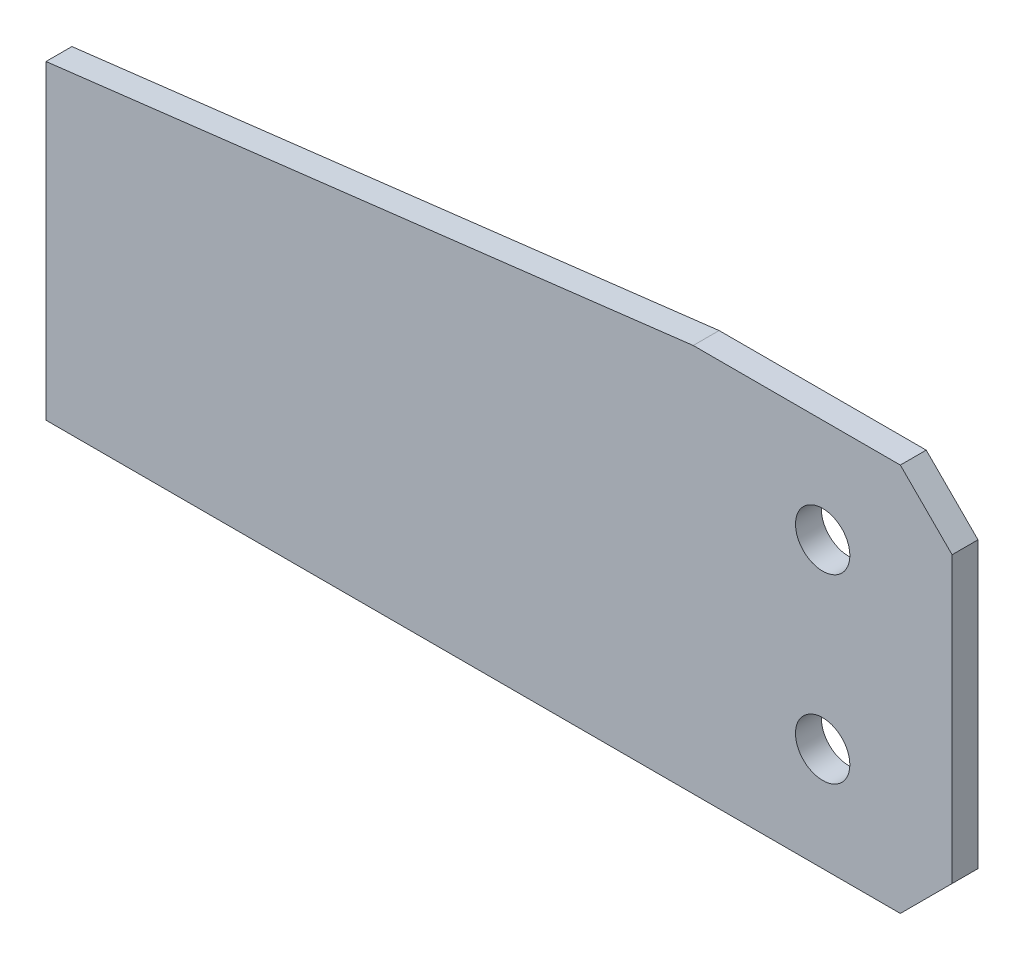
ISO-10303-21;
HEADER;
FILE_DESCRIPTION(('STEP AP214'),'2;1');
FILE_NAME('part.step','',(''),(''),'','','');
FILE_SCHEMA(('AUTOMOTIVE_DESIGN { 1 0 10303 214 1 1 1 1 }'));
ENDSEC;
DATA;
#1=APPLICATION_CONTEXT('core data for automotive mechanical design processes');
#2=APPLICATION_PROTOCOL_DEFINITION('international standard','automotive_design',2000,#1);
#3=PRODUCT_CONTEXT('',#1,'mechanical');
#4=PRODUCT('Part','Part','',(#3));
#5=PRODUCT_RELATED_PRODUCT_CATEGORY('part','',(#4));
#6=PRODUCT_DEFINITION_FORMATION('','',#4);
#7=PRODUCT_DEFINITION_CONTEXT('part definition',#1,'design');
#8=PRODUCT_DEFINITION('design','',#6,#7);
#9=PRODUCT_DEFINITION_SHAPE('','',#8);
#10=(LENGTH_UNIT() NAMED_UNIT(*) SI_UNIT(.MILLI.,.METRE.));
#11=(NAMED_UNIT(*) PLANE_ANGLE_UNIT() SI_UNIT($,.RADIAN.));
#12=(NAMED_UNIT(*) SI_UNIT($,.STERADIAN.) SOLID_ANGLE_UNIT());
#13=UNCERTAINTY_MEASURE_WITH_UNIT(LENGTH_MEASURE(1.E-05),#10,'distance_accuracy_value','');
#14=(GEOMETRIC_REPRESENTATION_CONTEXT(3) GLOBAL_UNCERTAINTY_ASSIGNED_CONTEXT((#13)) GLOBAL_UNIT_ASSIGNED_CONTEXT((#10,
#11,#12)) REPRESENTATION_CONTEXT('',''));
#15=CARTESIAN_POINT('',(0.,0.,0.));
#16=DIRECTION('',(0.,0.,1.));
#17=DIRECTION('',(1.,0.,0.));
#18=AXIS2_PLACEMENT_3D('',#15,#16,#17);
#19=CARTESIAN_POINT('',(-350.,-150.,10.));
#20=DIRECTION('',(0.,0.,-1.));
#21=DIRECTION('',(-1.,0.,0.));
#22=AXIS2_PLACEMENT_3D('',#19,#20,#21);
#23=PLANE('',#22);
#24=CARTESIAN_POINT('',(-50.,-40.,10.));
#25=DIRECTION('',(0.,0.,1.));
#26=DIRECTION('',(1.,0.,0.));
#27=AXIS2_PLACEMENT_3D('',#24,#25,#26);
#28=CIRCLE('',#27,10.5);
#29=CARTESIAN_POINT('',(-39.5,-40.,10.));
#30=VERTEX_POINT('',#29);
#31=EDGE_CURVE('E107',#30,#30,#28,.T.);
#32=ORIENTED_EDGE('',*,*,#31,.F.);
#33=EDGE_LOOP('',(#32));
#34=FACE_BOUND('',#33,.T.);
#35=DIRECTION('',(0.,-1.,0.));
#36=VECTOR('',#35,1.);
#37=CARTESIAN_POINT('',(-350.,-30.0000000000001,10.));
#38=LINE('',#37,#36);
#39=CARTESIAN_POINT('',(-350.,-30.0000000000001,10.));
#40=VERTEX_POINT('',#39);
#41=CARTESIAN_POINT('',(-350.,-150.,10.));
#42=VERTEX_POINT('',#41);
#43=EDGE_CURVE('E123',#40,#42,#38,.T.);
#44=ORIENTED_EDGE('',*,*,#43,.T.);
#45=DIRECTION('',(1.,0.,0.));
#46=VECTOR('',#45,1.);
#47=CARTESIAN_POINT('',(-20.,-150.,10.));
#48=LINE('',#47,#46);
#49=CARTESIAN_POINT('',(-20.,-150.,10.));
#50=VERTEX_POINT('',#49);
#51=EDGE_CURVE('E102',#42,#50,#48,.T.);
#52=ORIENTED_EDGE('',*,*,#51,.T.);
#53=DIRECTION('',(0.707106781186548,0.707106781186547,0.));
#54=VECTOR('',#53,1.);
#55=CARTESIAN_POINT('',(0.,-130.,10.));
#56=LINE('',#55,#54);
#57=CARTESIAN_POINT('',(0.,-130.,10.));
#58=VERTEX_POINT('',#57);
#59=EDGE_CURVE('E126',#50,#58,#56,.T.);
#60=ORIENTED_EDGE('',*,*,#59,.T.);
#61=DIRECTION('',(0.,1.,0.));
#62=VECTOR('',#61,1.);
#63=CARTESIAN_POINT('',(0.,-19.9999999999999,10.));
#64=LINE('',#63,#62);
#65=CARTESIAN_POINT('',(0.,-19.9999999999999,10.));
#66=VERTEX_POINT('',#65);
#67=EDGE_CURVE('E128',#58,#66,#64,.T.);
#68=ORIENTED_EDGE('',*,*,#67,.T.);
#69=DIRECTION('',(-0.707106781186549,0.707106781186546,0.));
#70=VECTOR('',#69,1.);
#71=CARTESIAN_POINT('',(0.,-19.9999999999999,10.));
#72=LINE('',#71,#70);
#73=CARTESIAN_POINT('',(-20.,0.,10.));
#74=VERTEX_POINT('',#73);
#75=EDGE_CURVE('E130',#66,#74,#72,.T.);
#76=ORIENTED_EDGE('',*,*,#75,.T.);
#77=DIRECTION('',(-1.,0.,0.));
#78=VECTOR('',#77,1.);
#79=CARTESIAN_POINT('',(-20.,0.,10.));
#80=LINE('',#79,#78);
#81=CARTESIAN_POINT('',(-100.,0.,10.));
#82=VERTEX_POINT('',#81);
#83=EDGE_CURVE('E49',#74,#82,#80,.T.);
#84=ORIENTED_EDGE('',*,*,#83,.T.);
#85=DIRECTION('',(-0.992876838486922,-0.119145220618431,0.));
#86=VECTOR('',#85,1.);
#87=CARTESIAN_POINT('',(-100.,0.,10.));
#88=LINE('',#87,#86);
#89=EDGE_CURVE('E44',#82,#40,#88,.T.);
#90=ORIENTED_EDGE('',*,*,#89,.T.);
#91=EDGE_LOOP('',(#44,#52,#60,#68,#76,#84,#90));
#92=FACE_BOUND('',#91,.T.);
#93=CARTESIAN_POINT('',(-50.,-110.,10.));
#94=DIRECTION('',(0.,0.,1.));
#95=DIRECTION('',(1.,0.,0.));
#96=AXIS2_PLACEMENT_3D('',#93,#94,#95);
#97=CIRCLE('',#96,10.5);
#98=CARTESIAN_POINT('',(-39.5,-110.,10.));
#99=VERTEX_POINT('',#98);
#100=EDGE_CURVE('E193',#99,#99,#97,.T.);
#101=ORIENTED_EDGE('',*,*,#100,.F.);
#102=EDGE_LOOP('',(#101));
#103=FACE_BOUND('',#102,.T.);
#104=ADVANCED_FACE('F29',(#34,#92,#103),#23,.F.);
#105=CARTESIAN_POINT('',(-350.,-150.,0.));
#106=DIRECTION('',(0.,0.,-1.));
#107=DIRECTION('',(-1.,0.,0.));
#108=AXIS2_PLACEMENT_3D('',#105,#106,#107);
#109=PLANE('',#108);
#110=CARTESIAN_POINT('',(-50.,-40.,0.));
#111=DIRECTION('',(0.,0.,1.));
#112=DIRECTION('',(1.,0.,0.));
#113=AXIS2_PLACEMENT_3D('',#110,#111,#112);
#114=CIRCLE('',#113,10.5);
#115=CARTESIAN_POINT('',(-39.5,-40.,0.));
#116=VERTEX_POINT('',#115);
#117=EDGE_CURVE('E110',#116,#116,#114,.T.);
#118=ORIENTED_EDGE('',*,*,#117,.T.);
#119=EDGE_LOOP('',(#118));
#120=FACE_BOUND('',#119,.T.);
#121=DIRECTION('',(0.,-1.,0.));
#122=VECTOR('',#121,1.);
#123=CARTESIAN_POINT('',(-350.,-30.0000000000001,0.));
#124=LINE('',#123,#122);
#125=CARTESIAN_POINT('',(-350.,-30.0000000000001,0.));
#126=VERTEX_POINT('',#125);
#127=CARTESIAN_POINT('',(-350.,-150.,0.));
#128=VERTEX_POINT('',#127);
#129=EDGE_CURVE('E93',#126,#128,#124,.T.);
#130=ORIENTED_EDGE('',*,*,#129,.F.);
#131=DIRECTION('',(-0.992876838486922,-0.119145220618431,0.));
#132=VECTOR('',#131,1.);
#133=CARTESIAN_POINT('',(-100.,0.,0.));
#134=LINE('',#133,#132);
#135=CARTESIAN_POINT('',(-100.,0.,0.));
#136=VERTEX_POINT('',#135);
#137=EDGE_CURVE('E121',#136,#126,#134,.T.);
#138=ORIENTED_EDGE('',*,*,#137,.F.);
#139=DIRECTION('',(-1.,0.,0.));
#140=VECTOR('',#139,1.);
#141=CARTESIAN_POINT('',(-20.,0.,0.));
#142=LINE('',#141,#140);
#143=CARTESIAN_POINT('',(-20.,0.,0.));
#144=VERTEX_POINT('',#143);
#145=EDGE_CURVE('E119',#144,#136,#142,.T.);
#146=ORIENTED_EDGE('',*,*,#145,.F.);
#147=DIRECTION('',(-0.707106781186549,0.707106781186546,0.));
#148=VECTOR('',#147,1.);
#149=CARTESIAN_POINT('',(0.,-19.9999999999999,0.));
#150=LINE('',#149,#148);
#151=CARTESIAN_POINT('',(0.,-19.9999999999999,0.));
#152=VERTEX_POINT('',#151);
#153=EDGE_CURVE('E117',#152,#144,#150,.T.);
#154=ORIENTED_EDGE('',*,*,#153,.F.);
#155=DIRECTION('',(0.,1.,0.));
#156=VECTOR('',#155,1.);
#157=CARTESIAN_POINT('',(0.,-19.9999999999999,0.));
#158=LINE('',#157,#156);
#159=CARTESIAN_POINT('',(0.,-130.,0.));
#160=VERTEX_POINT('',#159);
#161=EDGE_CURVE('E115',#160,#152,#158,.T.);
#162=ORIENTED_EDGE('',*,*,#161,.F.);
#163=DIRECTION('',(0.707106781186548,0.707106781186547,0.));
#164=VECTOR('',#163,1.);
#165=CARTESIAN_POINT('',(0.,-130.,0.));
#166=LINE('',#165,#164);
#167=CARTESIAN_POINT('',(-20.,-150.,0.));
#168=VERTEX_POINT('',#167);
#169=EDGE_CURVE('E95',#168,#160,#166,.T.);
#170=ORIENTED_EDGE('',*,*,#169,.F.);
#171=DIRECTION('',(1.,0.,0.));
#172=VECTOR('',#171,1.);
#173=CARTESIAN_POINT('',(-20.,-150.,0.));
#174=LINE('',#173,#172);
#175=EDGE_CURVE('E88',#128,#168,#174,.T.);
#176=ORIENTED_EDGE('',*,*,#175,.F.);
#177=EDGE_LOOP('',(#130,#138,#146,#154,#162,#170,#176));
#178=FACE_BOUND('',#177,.T.);
#179=CARTESIAN_POINT('',(-50.,-110.,0.));
#180=DIRECTION('',(0.,0.,1.));
#181=DIRECTION('',(1.,0.,0.));
#182=AXIS2_PLACEMENT_3D('',#179,#180,#181);
#183=CIRCLE('',#182,10.5);
#184=CARTESIAN_POINT('',(-39.5,-110.,0.));
#185=VERTEX_POINT('',#184);
#186=EDGE_CURVE('E196',#185,#185,#183,.T.);
#187=ORIENTED_EDGE('',*,*,#186,.T.);
#188=EDGE_LOOP('',(#187));
#189=FACE_BOUND('',#188,.T.);
#190=ADVANCED_FACE('F89',(#120,#178,#189),#109,.T.);
#191=CARTESIAN_POINT('',(-350.,-30.0000000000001,10.));
#192=DIRECTION('',(1.,0.,0.));
#193=DIRECTION('',(0.,0.,-1.));
#194=AXIS2_PLACEMENT_3D('',#191,#192,#193);
#195=PLANE('',#194);
#196=ORIENTED_EDGE('',*,*,#129,.T.);
#197=DIRECTION('',(0.,0.,-1.));
#198=VECTOR('',#197,1.);
#199=CARTESIAN_POINT('',(-350.,-150.,10.));
#200=LINE('',#199,#198);
#201=EDGE_CURVE('E11',#42,#128,#200,.T.);
#202=ORIENTED_EDGE('',*,*,#201,.F.);
#203=ORIENTED_EDGE('',*,*,#43,.F.);
#204=DIRECTION('',(0.,0.,-1.));
#205=VECTOR('',#204,1.);
#206=CARTESIAN_POINT('',(-350.,-30.0000000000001,10.));
#207=LINE('',#206,#205);
#208=EDGE_CURVE('E106',#40,#126,#207,.T.);
#209=ORIENTED_EDGE('',*,*,#208,.T.);
#210=EDGE_LOOP('',(#196,#202,#203,#209));
#211=FACE_BOUND('',#210,.T.);
#212=ADVANCED_FACE('F31',(#211),#195,.F.);
#213=CARTESIAN_POINT('',(-20.,-150.,10.));
#214=DIRECTION('',(0.,1.,0.));
#215=DIRECTION('',(-1.,0.,0.));
#216=AXIS2_PLACEMENT_3D('',#213,#214,#215);
#217=PLANE('',#216);
#218=ORIENTED_EDGE('',*,*,#175,.T.);
#219=DIRECTION('',(0.,0.,-1.));
#220=VECTOR('',#219,1.);
#221=CARTESIAN_POINT('',(-20.,-150.,10.));
#222=LINE('',#221,#220);
#223=EDGE_CURVE('E37',#50,#168,#222,.T.);
#224=ORIENTED_EDGE('',*,*,#223,.F.);
#225=ORIENTED_EDGE('',*,*,#51,.F.);
#226=ORIENTED_EDGE('',*,*,#201,.T.);
#227=EDGE_LOOP('',(#218,#224,#225,#226));
#228=FACE_BOUND('',#227,.T.);
#229=ADVANCED_FACE('F101',(#228),#217,.F.);
#230=CARTESIAN_POINT('',(0.,-130.,10.));
#231=DIRECTION('',(-0.707106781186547,0.707106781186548,0.));
#232=DIRECTION('',(-0.707106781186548,-0.707106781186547,0.));
#233=AXIS2_PLACEMENT_3D('',#230,#231,#232);
#234=PLANE('',#233);
#235=ORIENTED_EDGE('',*,*,#169,.T.);
#236=DIRECTION('',(0.,0.,-1.));
#237=VECTOR('',#236,1.);
#238=CARTESIAN_POINT('',(0.,-130.,10.));
#239=LINE('',#238,#237);
#240=EDGE_CURVE('E144',#58,#160,#239,.T.);
#241=ORIENTED_EDGE('',*,*,#240,.F.);
#242=ORIENTED_EDGE('',*,*,#59,.F.);
#243=ORIENTED_EDGE('',*,*,#223,.T.);
#244=EDGE_LOOP('',(#235,#241,#242,#243));
#245=FACE_BOUND('',#244,.T.);
#246=ADVANCED_FACE('F148',(#245),#234,.F.);
#247=CARTESIAN_POINT('',(0.,-19.9999999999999,10.));
#248=DIRECTION('',(-1.,0.,0.));
#249=DIRECTION('',(0.,-1.,0.));
#250=AXIS2_PLACEMENT_3D('',#247,#248,#249);
#251=PLANE('',#250);
#252=ORIENTED_EDGE('',*,*,#161,.T.);
#253=DIRECTION('',(0.,0.,-1.));
#254=VECTOR('',#253,1.);
#255=CARTESIAN_POINT('',(0.,-19.9999999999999,10.));
#256=LINE('',#255,#254);
#257=EDGE_CURVE('E141',#66,#152,#256,.T.);
#258=ORIENTED_EDGE('',*,*,#257,.F.);
#259=ORIENTED_EDGE('',*,*,#67,.F.);
#260=ORIENTED_EDGE('',*,*,#240,.T.);
#261=EDGE_LOOP('',(#252,#258,#259,#260));
#262=FACE_BOUND('',#261,.T.);
#263=ADVANCED_FACE('F156',(#262),#251,.F.);
#264=CARTESIAN_POINT('',(0.,-19.9999999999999,10.));
#265=DIRECTION('',(-0.707106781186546,-0.707106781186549,0.));
#266=DIRECTION('',(0.707106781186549,-0.707106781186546,0.));
#267=AXIS2_PLACEMENT_3D('',#264,#265,#266);
#268=PLANE('',#267);
#269=ORIENTED_EDGE('',*,*,#153,.T.);
#270=DIRECTION('',(0.,0.,-1.));
#271=VECTOR('',#270,1.);
#272=CARTESIAN_POINT('',(-20.,0.,10.));
#273=LINE('',#272,#271);
#274=EDGE_CURVE('E138',#74,#144,#273,.T.);
#275=ORIENTED_EDGE('',*,*,#274,.F.);
#276=ORIENTED_EDGE('',*,*,#75,.F.);
#277=ORIENTED_EDGE('',*,*,#257,.T.);
#278=EDGE_LOOP('',(#269,#275,#276,#277));
#279=FACE_BOUND('',#278,.T.);
#280=ADVANCED_FACE('F159',(#279),#268,.F.);
#281=CARTESIAN_POINT('',(-20.,0.,10.));
#282=DIRECTION('',(0.,-1.,0.));
#283=DIRECTION('',(1.,0.,0.));
#284=AXIS2_PLACEMENT_3D('',#281,#282,#283);
#285=PLANE('',#284);
#286=ORIENTED_EDGE('',*,*,#145,.T.);
#287=DIRECTION('',(0.,0.,-1.));
#288=VECTOR('',#287,1.);
#289=CARTESIAN_POINT('',(-100.,0.,10.));
#290=LINE('',#289,#288);
#291=EDGE_CURVE('E135',#82,#136,#290,.T.);
#292=ORIENTED_EDGE('',*,*,#291,.F.);
#293=ORIENTED_EDGE('',*,*,#83,.F.);
#294=ORIENTED_EDGE('',*,*,#274,.T.);
#295=EDGE_LOOP('',(#286,#292,#293,#294));
#296=FACE_BOUND('',#295,.T.);
#297=ADVANCED_FACE('F162',(#296),#285,.F.);
#298=CARTESIAN_POINT('',(-100.,0.,10.));
#299=DIRECTION('',(0.119145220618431,-0.992876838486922,0.));
#300=DIRECTION('',(0.992876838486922,0.119145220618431,0.));
#301=AXIS2_PLACEMENT_3D('',#298,#299,#300);
#302=PLANE('',#301);
#303=ORIENTED_EDGE('',*,*,#137,.T.);
#304=ORIENTED_EDGE('',*,*,#208,.F.);
#305=ORIENTED_EDGE('',*,*,#89,.F.);
#306=ORIENTED_EDGE('',*,*,#291,.T.);
#307=EDGE_LOOP('',(#303,#304,#305,#306));
#308=FACE_BOUND('',#307,.T.);
#309=ADVANCED_FACE('F164',(#308),#302,.F.);
#310=CARTESIAN_POINT('',(-50.,-40.,10.));
#311=DIRECTION('',(0.,0.,-1.));
#312=DIRECTION('',(-1.,0.,0.));
#313=AXIS2_PLACEMENT_3D('',#310,#311,#312);
#314=CYLINDRICAL_SURFACE('',#313,10.5);
#315=ORIENTED_EDGE('',*,*,#31,.T.);
#316=EDGE_LOOP('',(#315));
#317=FACE_BOUND('',#316,.T.);
#318=ORIENTED_EDGE('',*,*,#117,.F.);
#319=EDGE_LOOP('',(#318));
#320=FACE_BOUND('',#319,.T.);
#321=ADVANCED_FACE('F166',(#317,#320),#314,.F.);
#322=CARTESIAN_POINT('',(-50.,-110.,10.));
#323=DIRECTION('',(0.,0.,-1.));
#324=DIRECTION('',(-1.,0.,0.));
#325=AXIS2_PLACEMENT_3D('',#322,#323,#324);
#326=CYLINDRICAL_SURFACE('',#325,10.5);
#327=ORIENTED_EDGE('',*,*,#100,.T.);
#328=EDGE_LOOP('',(#327));
#329=FACE_BOUND('',#328,.T.);
#330=ORIENTED_EDGE('',*,*,#186,.F.);
#331=EDGE_LOOP('',(#330));
#332=FACE_BOUND('',#331,.T.);
#333=ADVANCED_FACE('F172',(#329,#332),#326,.F.);
#334=CLOSED_SHELL('',(#104,#190,#212,#229,#246,#263,#280,#297,#309,#321,#333));
#335=MANIFOLD_SOLID_BREP('B2',#334);
#336=ADVANCED_BREP_SHAPE_REPRESENTATION('',(#18,#335),#14);
#337=SHAPE_DEFINITION_REPRESENTATION(#9,#336);
ENDSEC;
END-ISO-10303-21;
